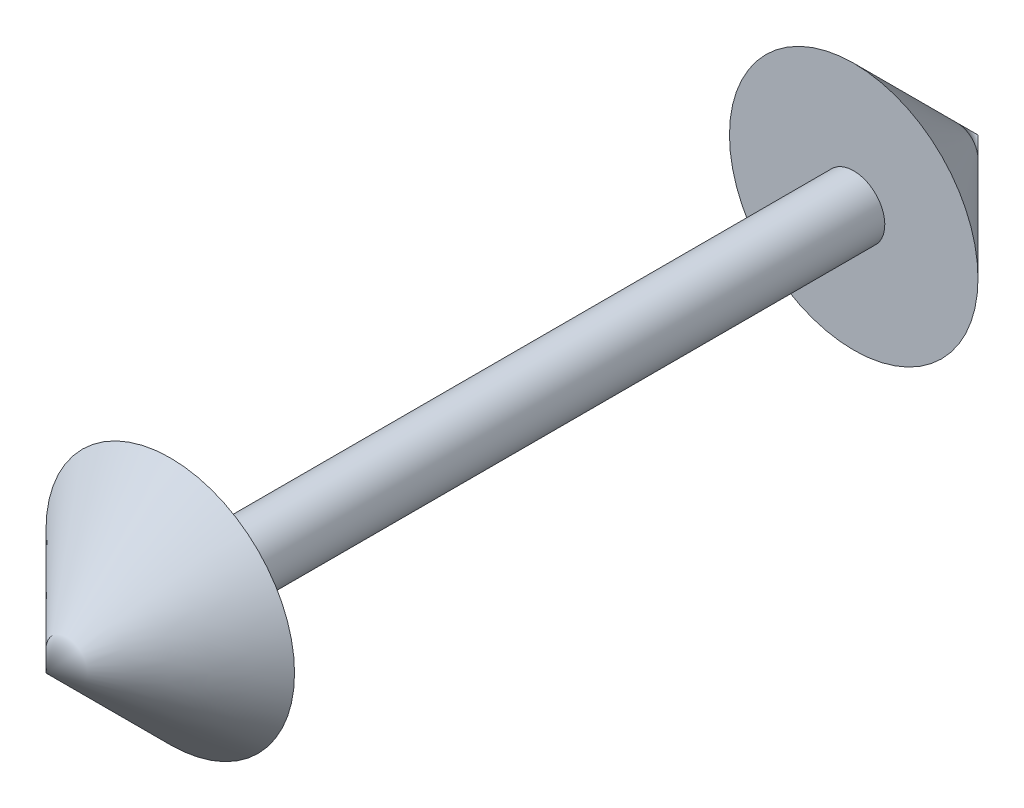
ISO-10303-21;
HEADER;
FILE_DESCRIPTION(('STEP AP214'),'2;1');
FILE_NAME('part.step','',(''),(''),'','','');
FILE_SCHEMA(('AUTOMOTIVE_DESIGN { 1 0 10303 214 1 1 1 1 }'));
ENDSEC;
DATA;
#1=APPLICATION_CONTEXT('core data for automotive mechanical design processes');
#2=APPLICATION_PROTOCOL_DEFINITION('international standard','automotive_design',2000,#1);
#3=PRODUCT_CONTEXT('',#1,'mechanical');
#4=PRODUCT('Part','Part','',(#3));
#5=PRODUCT_RELATED_PRODUCT_CATEGORY('part','',(#4));
#6=PRODUCT_DEFINITION_FORMATION('','',#4);
#7=PRODUCT_DEFINITION_CONTEXT('part definition',#1,'design');
#8=PRODUCT_DEFINITION('design','',#6,#7);
#9=PRODUCT_DEFINITION_SHAPE('','',#8);
#10=(LENGTH_UNIT() NAMED_UNIT(*) SI_UNIT(.MILLI.,.METRE.));
#11=(NAMED_UNIT(*) PLANE_ANGLE_UNIT() SI_UNIT($,.RADIAN.));
#12=(NAMED_UNIT(*) SI_UNIT($,.STERADIAN.) SOLID_ANGLE_UNIT());
#13=UNCERTAINTY_MEASURE_WITH_UNIT(LENGTH_MEASURE(1.E-05),#10,'distance_accuracy_value','');
#14=(GEOMETRIC_REPRESENTATION_CONTEXT(3) GLOBAL_UNCERTAINTY_ASSIGNED_CONTEXT((#13)) GLOBAL_UNIT_ASSIGNED_CONTEXT((#10,
#11,#12)) REPRESENTATION_CONTEXT('',''));
#15=CARTESIAN_POINT('',(0.,0.,0.));
#16=DIRECTION('',(0.,0.,1.));
#17=DIRECTION('',(1.,0.,0.));
#18=AXIS2_PLACEMENT_3D('',#15,#16,#17);
#19=CARTESIAN_POINT('',(0.,0.,110.));
#20=DIRECTION('',(0.,0.,-1.));
#21=DIRECTION('',(-1.,0.,0.));
#22=AXIS2_PLACEMENT_3D('',#19,#20,#21);
#23=CYLINDRICAL_SURFACE('',#22,10.);
#24=CARTESIAN_POINT('',(0.,0.,0.));
#25=DIRECTION('',(0.,0.,1.));
#26=DIRECTION('',(0.,-1.,0.));
#27=AXIS2_PLACEMENT_3D('',#24,#25,#26);
#28=CIRCLE('',#27,10.);
#29=CARTESIAN_POINT('',(0.,-10.,0.));
#30=VERTEX_POINT('',#29);
#31=EDGE_CURVE('E11',#30,#30,#28,.T.);
#32=ORIENTED_EDGE('',*,*,#31,.T.);
#33=EDGE_LOOP('',(#32));
#34=FACE_BOUND('',#33,.T.);
#35=CARTESIAN_POINT('',(0.,0.,220.));
#36=DIRECTION('',(0.,0.,1.));
#37=DIRECTION('',(1.,0.,0.));
#38=AXIS2_PLACEMENT_3D('',#35,#36,#37);
#39=CIRCLE('',#38,10.);
#40=CARTESIAN_POINT('',(10.,0.,220.));
#41=VERTEX_POINT('',#40);
#42=EDGE_CURVE('E68',#41,#41,#39,.T.);
#43=ORIENTED_EDGE('',*,*,#42,.F.);
#44=EDGE_LOOP('',(#43));
#45=FACE_BOUND('',#44,.T.);
#46=ADVANCED_FACE('F32',(#34,#45),#23,.T.);
#47=CARTESIAN_POINT('',(0.,0.,0.));
#48=DIRECTION('',(0.,0.,1.));
#49=DIRECTION('',(0.,-1.,0.));
#50=AXIS2_PLACEMENT_3D('',#47,#48,#49);
#51=PLANE('',#50);
#52=CARTESIAN_POINT('',(0.,0.,0.));
#53=DIRECTION('',(0.,0.,-1.));
#54=DIRECTION('',(0.,1.,0.));
#55=AXIS2_PLACEMENT_3D('',#52,#53,#54);
#56=CIRCLE('',#55,40.);
#57=CARTESIAN_POINT('',(0.,40.,0.));
#58=VERTEX_POINT('',#57);
#59=EDGE_CURVE('E39',#58,#58,#56,.T.);
#60=ORIENTED_EDGE('',*,*,#59,.F.);
#61=EDGE_LOOP('',(#60));
#62=FACE_BOUND('',#61,.T.);
#63=ORIENTED_EDGE('',*,*,#31,.F.);
#64=EDGE_LOOP('',(#63));
#65=FACE_BOUND('',#64,.T.);
#66=ADVANCED_FACE('F58',(#62,#65),#51,.T.);
#67=CARTESIAN_POINT('',(0.,0.,-40.));
#68=DIRECTION('',(0.,0.,1.));
#69=DIRECTION('',(0.,-1.,0.));
#70=AXIS2_PLACEMENT_3D('',#67,#68,#69);
#71=CONICAL_SURFACE('',#70,0.,0.785398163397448);
#72=ORIENTED_EDGE('',*,*,#59,.T.);
#73=EDGE_LOOP('',(#72));
#74=FACE_BOUND('',#73,.T.);
#75=CARTESIAN_POINT('',(0.,0.,-40.));
#76=VERTEX_POINT('',#75);
#77=VERTEX_LOOP('',#76);
#78=FACE_BOUND('',#77,.T.);
#79=ADVANCED_FACE('F53',(#74,#78),#71,.T.);
#80=CARTESIAN_POINT('',(0.,0.,220.));
#81=DIRECTION('',(0.,0.,-1.));
#82=DIRECTION('',(0.,-1.,0.));
#83=AXIS2_PLACEMENT_3D('',#80,#81,#82);
#84=PLANE('',#83);
#85=CARTESIAN_POINT('',(0.,0.,220.));
#86=DIRECTION('',(0.,0.,-1.));
#87=DIRECTION('',(0.,1.,0.));
#88=AXIS2_PLACEMENT_3D('',#85,#86,#87);
#89=CIRCLE('',#88,40.);
#90=CARTESIAN_POINT('',(0.,40.,220.));
#91=VERTEX_POINT('',#90);
#92=EDGE_CURVE('E70',#91,#91,#89,.T.);
#93=ORIENTED_EDGE('',*,*,#92,.T.);
#94=EDGE_LOOP('',(#93));
#95=FACE_BOUND('',#94,.T.);
#96=ORIENTED_EDGE('',*,*,#42,.T.);
#97=EDGE_LOOP('',(#96));
#98=FACE_BOUND('',#97,.T.);
#99=ADVANCED_FACE('F47',(#95,#98),#84,.T.);
#100=CARTESIAN_POINT('',(0.,0.,260.));
#101=DIRECTION('',(0.,0.,-1.));
#102=DIRECTION('',(0.,-1.,0.));
#103=AXIS2_PLACEMENT_3D('',#100,#101,#102);
#104=CONICAL_SURFACE('',#103,0.,0.785398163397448);
#105=ORIENTED_EDGE('',*,*,#92,.F.);
#106=EDGE_LOOP('',(#105));
#107=FACE_BOUND('',#106,.T.);
#108=CARTESIAN_POINT('',(0.,0.,260.));
#109=VERTEX_POINT('',#108);
#110=VERTEX_LOOP('',#109);
#111=FACE_BOUND('',#110,.T.);
#112=ADVANCED_FACE('F45',(#107,#111),#104,.T.);
#113=CLOSED_SHELL('',(#46,#66,#79,#99,#112));
#114=MANIFOLD_SOLID_BREP('B2',#113);
#115=ADVANCED_BREP_SHAPE_REPRESENTATION('',(#18,#114),#14);
#116=SHAPE_DEFINITION_REPRESENTATION(#9,#115);
ENDSEC;
END-ISO-10303-21;
